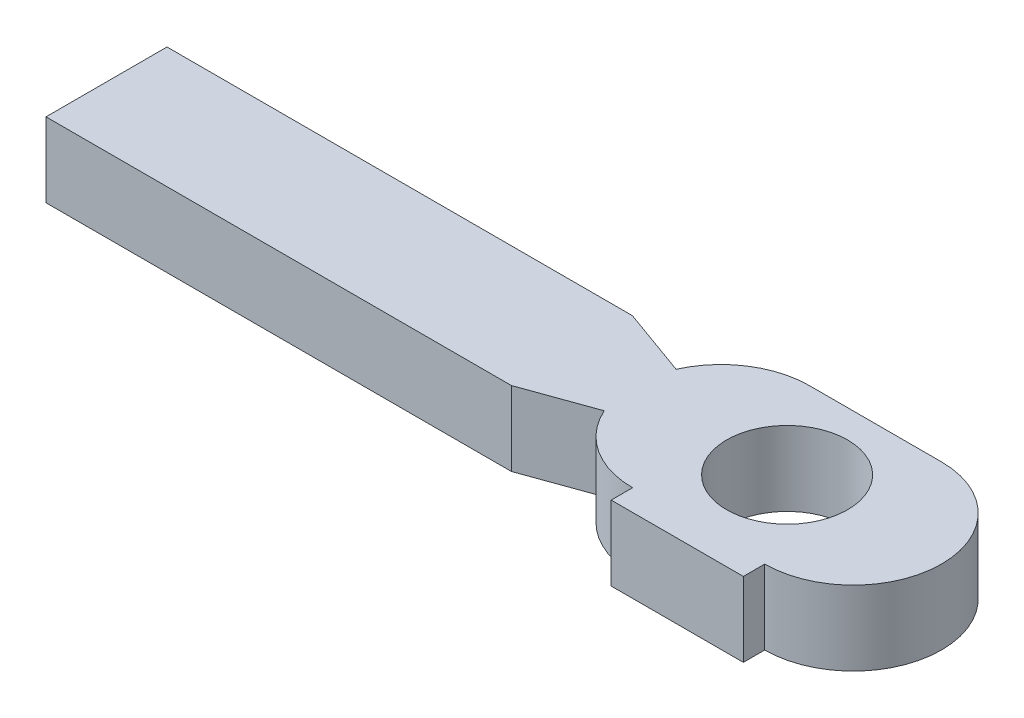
ISO-10303-21;
HEADER;
FILE_DESCRIPTION(('STEP AP214'),'2;1');
FILE_NAME('part.step','',(''),(''),'','','');
FILE_SCHEMA(('AUTOMOTIVE_DESIGN { 1 0 10303 214 1 1 1 1 }'));
ENDSEC;
DATA;
#1=APPLICATION_CONTEXT('core data for automotive mechanical design processes');
#2=APPLICATION_PROTOCOL_DEFINITION('international standard','automotive_design',2000,#1);
#3=PRODUCT_CONTEXT('',#1,'mechanical');
#4=PRODUCT('Part','Part','',(#3));
#5=PRODUCT_RELATED_PRODUCT_CATEGORY('part','',(#4));
#6=PRODUCT_DEFINITION_FORMATION('','',#4);
#7=PRODUCT_DEFINITION_CONTEXT('part definition',#1,'design');
#8=PRODUCT_DEFINITION('design','',#6,#7);
#9=PRODUCT_DEFINITION_SHAPE('','',#8);
#10=(LENGTH_UNIT() NAMED_UNIT(*) SI_UNIT(.MILLI.,.METRE.));
#11=(NAMED_UNIT(*) PLANE_ANGLE_UNIT() SI_UNIT($,.RADIAN.));
#12=(NAMED_UNIT(*) SI_UNIT($,.STERADIAN.) SOLID_ANGLE_UNIT());
#13=UNCERTAINTY_MEASURE_WITH_UNIT(LENGTH_MEASURE(1.E-05),#10,'distance_accuracy_value','');
#14=(GEOMETRIC_REPRESENTATION_CONTEXT(3) GLOBAL_UNCERTAINTY_ASSIGNED_CONTEXT((#13)) GLOBAL_UNIT_ASSIGNED_CONTEXT((#10,
#11,#12)) REPRESENTATION_CONTEXT('',''));
#15=CARTESIAN_POINT('',(0.,0.,0.));
#16=DIRECTION('',(0.,0.,1.));
#17=DIRECTION('',(1.,0.,0.));
#18=AXIS2_PLACEMENT_3D('',#15,#16,#17);
#19=CARTESIAN_POINT('',(1.84067736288,-5.,66.20740131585));
#20=DIRECTION('',(0.,-1.,0.));
#21=DIRECTION('',(0.,0.,1.));
#22=AXIS2_PLACEMENT_3D('',#19,#20,#21);
#23=PLANE('',#22);
#24=CARTESIAN_POINT('',(0.,-5.,67.2));
#25=DIRECTION('',(0.,-1.,0.));
#26=DIRECTION('',(0.,0.,-1.));
#27=AXIS2_PLACEMENT_3D('',#24,#25,#26);
#28=CIRCLE('',#27,0.649999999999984);
#29=CARTESIAN_POINT('',(0.,-5.,66.55));
#30=VERTEX_POINT('',#29);
#31=EDGE_CURVE('E133',#30,#30,#28,.F.);
#32=ORIENTED_EDGE('',*,*,#31,.T.);
#33=EDGE_LOOP('',(#32));
#34=FACE_BOUND('',#33,.T.);
#35=DIRECTION('',(0.,0.,-1.));
#36=VECTOR('',#35,1.);
#37=CARTESIAN_POINT('',(0.71,-5.,68.26496710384));
#38=LINE('',#37,#36);
#39=CARTESIAN_POINT('',(0.71,-5.,68.15));
#40=VERTEX_POINT('',#39);
#41=CARTESIAN_POINT('',(0.71,-5.,68.37993420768));
#42=VERTEX_POINT('',#41);
#43=EDGE_CURVE('E185',#40,#42,#38,.F.);
#44=ORIENTED_EDGE('',*,*,#43,.T.);
#45=DIRECTION('',(1.,0.,0.));
#46=VECTOR('',#45,1.);
#47=CARTESIAN_POINT('',(0.,-5.,68.37993420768));
#48=LINE('',#47,#46);
#49=CARTESIAN_POINT('',(-0.71,-5.,68.37993420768));
#50=VERTEX_POINT('',#49);
#51=EDGE_CURVE('E180',#42,#50,#48,.F.);
#52=ORIENTED_EDGE('',*,*,#51,.T.);
#53=DIRECTION('',(0.,0.,1.));
#54=VECTOR('',#53,1.);
#55=CARTESIAN_POINT('',(-0.71,-5.,68.26496710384));
#56=LINE('',#55,#54);
#57=CARTESIAN_POINT('',(-0.710000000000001,-5.,68.15));
#58=VERTEX_POINT('',#57);
#59=EDGE_CURVE('E174',#50,#58,#56,.F.);
#60=ORIENTED_EDGE('',*,*,#59,.T.);
#61=CARTESIAN_POINT('',(-0.71,-5.,67.2));
#62=DIRECTION('',(0.,-1.,0.));
#63=DIRECTION('',(0.,0.,-1.));
#64=AXIS2_PLACEMENT_3D('',#61,#62,#63);
#65=CIRCLE('',#64,0.95);
#66=CARTESIAN_POINT('',(-1.57806704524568,-5.,67.5859528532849));
#67=VERTEX_POINT('',#66);
#68=EDGE_CURVE('E208',#58,#67,#65,.T.);
#69=ORIENTED_EDGE('',*,*,#68,.T.);
#70=DIRECTION('',(0.940934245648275,0.,-0.338589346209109));
#71=VECTOR('',#70,1.);
#72=CARTESIAN_POINT('',(-1.944958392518,-5.,67.71797642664));
#73=LINE('',#72,#71);
#74=CARTESIAN_POINT('',(-2.31184973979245,-5.,67.8499999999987));
#75=VERTEX_POINT('',#74);
#76=EDGE_CURVE('E169',#67,#75,#73,.F.);
#77=ORIENTED_EDGE('',*,*,#76,.T.);
#78=DIRECTION('',(1.,0.,0.));
#79=VECTOR('',#78,1.);
#80=CARTESIAN_POINT('',(-4.811849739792,-5.,67.85));
#81=LINE('',#80,#79);
#82=CARTESIAN_POINT('',(-7.311849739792,-5.,67.85));
#83=VERTEX_POINT('',#82);
#84=EDGE_CURVE('E162',#75,#83,#81,.F.);
#85=ORIENTED_EDGE('',*,*,#84,.T.);
#86=DIRECTION('',(0.,0.,1.));
#87=VECTOR('',#86,1.);
#88=CARTESIAN_POINT('',(-7.311849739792,-5.,67.2));
#89=LINE('',#88,#87);
#90=CARTESIAN_POINT('',(-7.311849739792,-5.,66.55));
#91=VERTEX_POINT('',#90);
#92=EDGE_CURVE('E148',#83,#91,#89,.F.);
#93=ORIENTED_EDGE('',*,*,#92,.T.);
#94=DIRECTION('',(-1.,0.,0.));
#95=VECTOR('',#94,1.);
#96=CARTESIAN_POINT('',(-4.811849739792,-5.,66.55));
#97=LINE('',#96,#95);
#98=CARTESIAN_POINT('',(-2.31184973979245,-5.,66.5500000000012));
#99=VERTEX_POINT('',#98);
#100=EDGE_CURVE('E134',#91,#99,#97,.F.);
#101=ORIENTED_EDGE('',*,*,#100,.T.);
#102=DIRECTION('',(-0.940934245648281,0.,-0.338589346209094));
#103=VECTOR('',#102,1.);
#104=CARTESIAN_POINT('',(-1.944958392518,-5.,66.68202357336));
#105=LINE('',#104,#103);
#106=CARTESIAN_POINT('',(-1.57806704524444,-5.,66.8140471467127));
#107=VERTEX_POINT('',#106);
#108=EDGE_CURVE('E104',#99,#107,#105,.F.);
#109=ORIENTED_EDGE('',*,*,#108,.T.);
#110=CARTESIAN_POINT('',(-0.71,-5.,67.2));
#111=DIRECTION('',(0.,-1.,0.));
#112=DIRECTION('',(0.,0.,-1.));
#113=AXIS2_PLACEMENT_3D('',#110,#111,#112);
#114=CIRCLE('',#113,0.95);
#115=CARTESIAN_POINT('',(-0.71,-5.,66.25));
#116=VERTEX_POINT('',#115);
#117=EDGE_CURVE('E20',#107,#116,#114,.T.);
#118=ORIENTED_EDGE('',*,*,#117,.T.);
#119=DIRECTION('',(-1.,0.,0.));
#120=VECTOR('',#119,1.);
#121=CARTESIAN_POINT('',(0.,-5.,66.25));
#122=LINE('',#121,#120);
#123=CARTESIAN_POINT('',(0.710000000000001,-5.,66.25));
#124=VERTEX_POINT('',#123);
#125=EDGE_CURVE('E107',#116,#124,#122,.F.);
#126=ORIENTED_EDGE('',*,*,#125,.T.);
#127=CARTESIAN_POINT('',(0.71,-5.,67.2));
#128=DIRECTION('',(0.,1.,0.));
#129=DIRECTION('',(0.,0.,1.));
#130=AXIS2_PLACEMENT_3D('',#127,#128,#129);
#131=CIRCLE('',#130,0.95);
#132=EDGE_CURVE('E209',#124,#40,#131,.F.);
#133=ORIENTED_EDGE('',*,*,#132,.T.);
#134=EDGE_LOOP('',(#44,#52,#60,#69,#77,#85,#93,#101,#109,#118,#126,#133));
#135=FACE_BOUND('',#134,.T.);
#136=ADVANCED_FACE('F16',(#34,#135),#23,.T.);
#137=CARTESIAN_POINT('',(-1.563391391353,-5.016,66.81932808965));
#138=DIRECTION('',(0.338589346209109,0.,-0.940934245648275));
#139=DIRECTION('',(-0.940934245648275,0.,-0.338589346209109));
#140=AXIS2_PLACEMENT_3D('',#137,#138,#139);
#141=PLANE('',#140);
#142=DIRECTION('',(0.,-1.,0.));
#143=VECTOR('',#142,1.);
#144=CARTESIAN_POINT('',(-2.311849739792,-4.6,66.55));
#145=LINE('',#144,#143);
#146=CARTESIAN_POINT('',(-2.3118497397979,-4.2,66.55));
#147=VERTEX_POINT('',#146);
#148=EDGE_CURVE('E130',#99,#147,#145,.F.);
#149=ORIENTED_EDGE('',*,*,#148,.T.);
#150=DIRECTION('',(-0.940934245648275,0.,-0.338589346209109));
#151=VECTOR('',#150,1.);
#152=CARTESIAN_POINT('',(-1.563391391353,-4.2,66.81932808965));
#153=LINE('',#152,#151);
#154=CARTESIAN_POINT('',(-1.57806704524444,-4.2,66.8140471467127));
#155=VERTEX_POINT('',#154);
#156=EDGE_CURVE('E203',#147,#155,#153,.F.);
#157=ORIENTED_EDGE('',*,*,#156,.T.);
#158=DIRECTION('',(0.,-1.,0.));
#159=VECTOR('',#158,1.);
#160=CARTESIAN_POINT('',(-1.57806704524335,-4.6,66.8140471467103));
#161=LINE('',#160,#159);
#162=EDGE_CURVE('E113',#155,#107,#161,.T.);
#163=ORIENTED_EDGE('',*,*,#162,.T.);
#164=ORIENTED_EDGE('',*,*,#108,.F.);
#165=EDGE_LOOP('',(#149,#157,#163,#164));
#166=FACE_BOUND('',#165,.T.);
#167=ADVANCED_FACE('F312',(#166),#141,.T.);
#168=CARTESIAN_POINT('',(-0.71,-4.2,67.2));
#169=DIRECTION('',(0.,-1.,0.));
#170=DIRECTION('',(0.,0.,-1.));
#171=AXIS2_PLACEMENT_3D('',#168,#169,#170);
#172=CYLINDRICAL_SURFACE('',#171,0.95);
#173=DIRECTION('',(0.,1.,0.));
#174=VECTOR('',#173,1.);
#175=CARTESIAN_POINT('',(-0.71,-4.6,66.25));
#176=LINE('',#175,#174);
#177=CARTESIAN_POINT('',(-0.71,-4.2,66.25));
#178=VERTEX_POINT('',#177);
#179=EDGE_CURVE('E112',#178,#116,#176,.F.);
#180=ORIENTED_EDGE('',*,*,#179,.T.);
#181=ORIENTED_EDGE('',*,*,#117,.F.);
#182=ORIENTED_EDGE('',*,*,#162,.F.);
#183=CARTESIAN_POINT('',(-0.71,-4.2,67.2));
#184=DIRECTION('',(0.,-1.,0.));
#185=DIRECTION('',(0.,0.,-1.));
#186=AXIS2_PLACEMENT_3D('',#183,#184,#185);
#187=CIRCLE('',#186,0.95);
#188=EDGE_CURVE('E124',#155,#178,#187,.T.);
#189=ORIENTED_EDGE('',*,*,#188,.T.);
#190=EDGE_LOOP('',(#180,#181,#182,#189));
#191=FACE_BOUND('',#190,.T.);
#192=ADVANCED_FACE('F122',(#191),#172,.T.);
#193=CARTESIAN_POINT('',(-0.7384,-4.184,66.25));
#194=DIRECTION('',(0.,0.,-1.));
#195=DIRECTION('',(1.,0.,0.));
#196=AXIS2_PLACEMENT_3D('',#193,#194,#195);
#197=PLANE('',#196);
#198=ORIENTED_EDGE('',*,*,#125,.F.);
#199=ORIENTED_EDGE('',*,*,#179,.F.);
#200=DIRECTION('',(1.,0.,0.));
#201=VECTOR('',#200,1.);
#202=CARTESIAN_POINT('',(-2.8253338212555,-4.2,66.25));
#203=LINE('',#202,#201);
#204=CARTESIAN_POINT('',(0.710000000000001,-4.2,66.25));
#205=VERTEX_POINT('',#204);
#206=EDGE_CURVE('E201',#178,#205,#203,.T.);
#207=ORIENTED_EDGE('',*,*,#206,.T.);
#208=DIRECTION('',(0.,-1.,0.));
#209=VECTOR('',#208,1.);
#210=CARTESIAN_POINT('',(0.710000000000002,-4.6,66.25));
#211=LINE('',#210,#209);
#212=EDGE_CURVE('E119',#205,#124,#211,.T.);
#213=ORIENTED_EDGE('',*,*,#212,.T.);
#214=EDGE_LOOP('',(#198,#199,#207,#213));
#215=FACE_BOUND('',#214,.T.);
#216=ADVANCED_FACE('F116',(#215),#197,.T.);
#217=CARTESIAN_POINT('',(0.71,-5.,67.2));
#218=DIRECTION('',(0.,1.,0.));
#219=DIRECTION('',(0.,0.,1.));
#220=AXIS2_PLACEMENT_3D('',#217,#218,#219);
#221=CYLINDRICAL_SURFACE('',#220,0.95);
#222=ORIENTED_EDGE('',*,*,#212,.F.);
#223=CARTESIAN_POINT('',(0.71,-4.2,67.2));
#224=DIRECTION('',(0.,1.,0.));
#225=DIRECTION('',(0.,0.,1.));
#226=AXIS2_PLACEMENT_3D('',#223,#224,#225);
#227=CIRCLE('',#226,0.95);
#228=CARTESIAN_POINT('',(0.71,-4.2,68.15));
#229=VERTEX_POINT('',#228);
#230=EDGE_CURVE('E197',#205,#229,#227,.F.);
#231=ORIENTED_EDGE('',*,*,#230,.T.);
#232=DIRECTION('',(0.,1.,0.));
#233=VECTOR('',#232,1.);
#234=CARTESIAN_POINT('',(0.71,-4.6,68.15));
#235=LINE('',#234,#233);
#236=EDGE_CURVE('E187',#229,#40,#235,.F.);
#237=ORIENTED_EDGE('',*,*,#236,.T.);
#238=ORIENTED_EDGE('',*,*,#132,.F.);
#239=EDGE_LOOP('',(#222,#231,#237,#238));
#240=FACE_BOUND('',#239,.T.);
#241=ADVANCED_FACE('F263',(#240),#221,.T.);
#242=CARTESIAN_POINT('',(0.71,-5.016,68.39104263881));
#243=DIRECTION('',(1.,0.,0.));
#244=DIRECTION('',(0.,0.,-1.));
#245=AXIS2_PLACEMENT_3D('',#242,#243,#244);
#246=PLANE('',#245);
#247=ORIENTED_EDGE('',*,*,#43,.F.);
#248=ORIENTED_EDGE('',*,*,#236,.F.);
#249=DIRECTION('',(0.,0.,1.));
#250=VECTOR('',#249,1.);
#251=CARTESIAN_POINT('',(0.71,-4.2,67.31496710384));
#252=LINE('',#251,#250);
#253=CARTESIAN_POINT('',(0.71,-4.2,68.37993420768));
#254=VERTEX_POINT('',#253);
#255=EDGE_CURVE('E200',#229,#254,#252,.T.);
#256=ORIENTED_EDGE('',*,*,#255,.T.);
#257=DIRECTION('',(0.,1.,0.));
#258=VECTOR('',#257,1.);
#259=CARTESIAN_POINT('',(0.71,-4.6,68.37993420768));
#260=LINE('',#259,#258);
#261=EDGE_CURVE('E182',#254,#42,#260,.F.);
#262=ORIENTED_EDGE('',*,*,#261,.T.);
#263=EDGE_LOOP('',(#247,#248,#256,#262));
#264=FACE_BOUND('',#263,.T.);
#265=ADVANCED_FACE('F261',(#264),#246,.T.);
#266=CARTESIAN_POINT('',(-0.7384,-5.016,68.37993420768));
#267=DIRECTION('',(0.,0.,1.));
#268=DIRECTION('',(1.,0.,0.));
#269=AXIS2_PLACEMENT_3D('',#266,#267,#268);
#270=PLANE('',#269);
#271=ORIENTED_EDGE('',*,*,#51,.F.);
#272=ORIENTED_EDGE('',*,*,#261,.F.);
#273=DIRECTION('',(-1.,0.,0.));
#274=VECTOR('',#273,1.);
#275=CARTESIAN_POINT('',(-2.8253338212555,-4.2,68.37993420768));
#276=LINE('',#275,#274);
#277=CARTESIAN_POINT('',(-0.710000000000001,-4.2,68.37993420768));
#278=VERTEX_POINT('',#277);
#279=EDGE_CURVE('E220',#254,#278,#276,.T.);
#280=ORIENTED_EDGE('',*,*,#279,.T.);
#281=DIRECTION('',(0.,1.,0.));
#282=VECTOR('',#281,1.);
#283=CARTESIAN_POINT('',(-0.71,-4.6,68.37993420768));
#284=LINE('',#283,#282);
#285=EDGE_CURVE('E177',#278,#50,#284,.F.);
#286=ORIENTED_EDGE('',*,*,#285,.T.);
#287=EDGE_LOOP('',(#271,#272,#280,#286));
#288=FACE_BOUND('',#287,.T.);
#289=ADVANCED_FACE('F259',(#288),#270,.T.);
#290=CARTESIAN_POINT('',(-0.71,-5.016,68.13889156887));
#291=DIRECTION('',(-1.,0.,0.));
#292=DIRECTION('',(0.,0.,1.));
#293=AXIS2_PLACEMENT_3D('',#290,#291,#292);
#294=PLANE('',#293);
#295=ORIENTED_EDGE('',*,*,#285,.F.);
#296=DIRECTION('',(0.,0.,-1.));
#297=VECTOR('',#296,1.);
#298=CARTESIAN_POINT('',(-0.710000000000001,-4.2,67.31496710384));
#299=LINE('',#298,#297);
#300=CARTESIAN_POINT('',(-0.710000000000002,-4.2,68.15));
#301=VERTEX_POINT('',#300);
#302=EDGE_CURVE('E196',#278,#301,#299,.T.);
#303=ORIENTED_EDGE('',*,*,#302,.T.);
#304=DIRECTION('',(0.,-1.,0.));
#305=VECTOR('',#304,1.);
#306=CARTESIAN_POINT('',(-0.710000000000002,-4.6,68.15));
#307=LINE('',#306,#305);
#308=EDGE_CURVE('E176',#301,#58,#307,.T.);
#309=ORIENTED_EDGE('',*,*,#308,.T.);
#310=ORIENTED_EDGE('',*,*,#59,.F.);
#311=EDGE_LOOP('',(#295,#303,#309,#310));
#312=FACE_BOUND('',#311,.T.);
#313=ADVANCED_FACE('F249',(#312),#294,.T.);
#314=CARTESIAN_POINT('',(-0.71,-4.2,67.2));
#315=DIRECTION('',(0.,-1.,0.));
#316=DIRECTION('',(0.,0.,-1.));
#317=AXIS2_PLACEMENT_3D('',#314,#315,#316);
#318=CYLINDRICAL_SURFACE('',#317,0.95);
#319=ORIENTED_EDGE('',*,*,#68,.F.);
#320=ORIENTED_EDGE('',*,*,#308,.F.);
#321=CARTESIAN_POINT('',(-0.71,-4.2,67.2));
#322=DIRECTION('',(0.,-1.,0.));
#323=DIRECTION('',(0.,0.,-1.));
#324=AXIS2_PLACEMENT_3D('',#321,#322,#323);
#325=CIRCLE('',#324,0.95);
#326=CARTESIAN_POINT('',(-1.57806704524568,-4.2,67.5859528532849));
#327=VERTEX_POINT('',#326);
#328=EDGE_CURVE('E193',#301,#327,#325,.T.);
#329=ORIENTED_EDGE('',*,*,#328,.T.);
#330=DIRECTION('',(0.,1.,0.));
#331=VECTOR('',#330,1.);
#332=CARTESIAN_POINT('',(-1.57806704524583,-4.6,67.5859528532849));
#333=LINE('',#332,#331);
#334=EDGE_CURVE('E171',#327,#67,#333,.F.);
#335=ORIENTED_EDGE('',*,*,#334,.T.);
#336=EDGE_LOOP('',(#319,#320,#329,#335));
#337=FACE_BOUND('',#336,.T.);
#338=ADVANCED_FACE('F291',(#337),#318,.T.);
#339=CARTESIAN_POINT('',(-2.326525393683,-5.016,67.85528094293));
#340=DIRECTION('',(0.338589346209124,0.,0.94093424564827));
#341=DIRECTION('',(0.94093424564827,0.,-0.338589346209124));
#342=AXIS2_PLACEMENT_3D('',#339,#340,#341);
#343=PLANE('',#342);
#344=DIRECTION('',(0.,1.,0.));
#345=VECTOR('',#344,1.);
#346=CARTESIAN_POINT('',(-2.311849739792,-4.6,67.85));
#347=LINE('',#346,#345);
#348=CARTESIAN_POINT('',(-2.31184973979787,-4.2,67.85));
#349=VERTEX_POINT('',#348);
#350=EDGE_CURVE('E166',#349,#75,#347,.F.);
#351=ORIENTED_EDGE('',*,*,#350,.T.);
#352=ORIENTED_EDGE('',*,*,#76,.F.);
#353=ORIENTED_EDGE('',*,*,#334,.F.);
#354=DIRECTION('',(0.94093424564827,0.,-0.338589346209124));
#355=VECTOR('',#354,1.);
#356=CARTESIAN_POINT('',(-2.326525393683,-4.2,67.85528094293));
#357=LINE('',#356,#355);
#358=EDGE_CURVE('E190',#327,#349,#357,.F.);
#359=ORIENTED_EDGE('',*,*,#358,.T.);
#360=EDGE_LOOP('',(#351,#352,#353,#359));
#361=FACE_BOUND('',#360,.T.);
#362=ADVANCED_FACE('F293',(#361),#343,.T.);
#363=CARTESIAN_POINT('',(-7.411849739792,-5.016,67.85));
#364=DIRECTION('',(0.,0.,1.));
#365=DIRECTION('',(1.,0.,0.));
#366=AXIS2_PLACEMENT_3D('',#363,#364,#365);
#367=PLANE('',#366);
#368=ORIENTED_EDGE('',*,*,#84,.F.);
#369=ORIENTED_EDGE('',*,*,#350,.F.);
#370=DIRECTION('',(-1.,0.,0.));
#371=VECTOR('',#370,1.);
#372=CARTESIAN_POINT('',(-2.8253338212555,-4.2,67.85));
#373=LINE('',#372,#371);
#374=CARTESIAN_POINT('',(-7.311849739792,-4.2,67.85));
#375=VERTEX_POINT('',#374);
#376=EDGE_CURVE('E157',#349,#375,#373,.T.);
#377=ORIENTED_EDGE('',*,*,#376,.T.);
#378=DIRECTION('',(0.,1.,0.));
#379=VECTOR('',#378,1.);
#380=CARTESIAN_POINT('',(-7.311849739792,-4.6,67.85));
#381=LINE('',#380,#379);
#382=EDGE_CURVE('E152',#375,#83,#381,.F.);
#383=ORIENTED_EDGE('',*,*,#382,.T.);
#384=EDGE_LOOP('',(#368,#369,#377,#383));
#385=FACE_BOUND('',#384,.T.);
#386=ADVANCED_FACE('F299',(#385),#367,.T.);
#387=CARTESIAN_POINT('',(-7.311849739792,-5.016,66.524));
#388=DIRECTION('',(-1.,0.,0.));
#389=DIRECTION('',(0.,0.,1.));
#390=AXIS2_PLACEMENT_3D('',#387,#388,#389);
#391=PLANE('',#390);
#392=ORIENTED_EDGE('',*,*,#92,.F.);
#393=ORIENTED_EDGE('',*,*,#382,.F.);
#394=DIRECTION('',(0.,0.,-1.));
#395=VECTOR('',#394,1.);
#396=CARTESIAN_POINT('',(-7.311849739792,-4.2,67.31496710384));
#397=LINE('',#396,#395);
#398=CARTESIAN_POINT('',(-7.311849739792,-4.2,66.55));
#399=VERTEX_POINT('',#398);
#400=EDGE_CURVE('E138',#375,#399,#397,.T.);
#401=ORIENTED_EDGE('',*,*,#400,.T.);
#402=DIRECTION('',(0.,1.,0.));
#403=VECTOR('',#402,1.);
#404=CARTESIAN_POINT('',(-7.311849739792,-4.6,66.55));
#405=LINE('',#404,#403);
#406=EDGE_CURVE('E35',#399,#91,#405,.F.);
#407=ORIENTED_EDGE('',*,*,#406,.T.);
#408=EDGE_LOOP('',(#392,#393,#401,#407));
#409=FACE_BOUND('',#408,.T.);
#410=ADVANCED_FACE('F289',(#409),#391,.T.);
#411=CARTESIAN_POINT('',(-2.211849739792,-5.016,66.55));
#412=DIRECTION('',(0.,0.,-1.));
#413=DIRECTION('',(-1.,0.,0.));
#414=AXIS2_PLACEMENT_3D('',#411,#412,#413);
#415=PLANE('',#414);
#416=ORIENTED_EDGE('',*,*,#100,.F.);
#417=ORIENTED_EDGE('',*,*,#406,.F.);
#418=DIRECTION('',(1.,0.,0.));
#419=VECTOR('',#418,1.);
#420=CARTESIAN_POINT('',(-2.8253338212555,-4.2,66.55));
#421=LINE('',#420,#419);
#422=EDGE_CURVE('E26',#399,#147,#421,.T.);
#423=ORIENTED_EDGE('',*,*,#422,.T.);
#424=ORIENTED_EDGE('',*,*,#148,.F.);
#425=EDGE_LOOP('',(#416,#417,#423,#424));
#426=FACE_BOUND('',#425,.T.);
#427=ADVANCED_FACE('F281',(#426),#415,.T.);
#428=CARTESIAN_POINT('',(0.,-4.2,67.2));
#429=DIRECTION('',(0.,-1.,0.));
#430=DIRECTION('',(0.,0.,-1.));
#431=AXIS2_PLACEMENT_3D('',#428,#429,#430);
#432=CYLINDRICAL_SURFACE('',#431,0.649999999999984);
#433=ORIENTED_EDGE('',*,*,#31,.F.);
#434=EDGE_LOOP('',(#433));
#435=FACE_BOUND('',#434,.T.);
#436=CARTESIAN_POINT('',(0.,-4.2,67.2));
#437=DIRECTION('',(0.,-1.,0.));
#438=DIRECTION('',(0.,0.,-1.));
#439=AXIS2_PLACEMENT_3D('',#436,#437,#438);
#440=CIRCLE('',#439,0.649999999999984);
#441=CARTESIAN_POINT('',(0.,-4.2,66.55));
#442=VERTEX_POINT('',#441);
#443=EDGE_CURVE('E11',#442,#442,#440,.F.);
#444=ORIENTED_EDGE('',*,*,#443,.T.);
#445=EDGE_LOOP('',(#444));
#446=FACE_BOUND('',#445,.T.);
#447=ADVANCED_FACE('F276',(#435,#446),#432,.F.);
#448=CARTESIAN_POINT('',(1.840642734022,-4.2,66.20740131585));
#449=DIRECTION('',(0.,-1.,0.));
#450=DIRECTION('',(0.,0.,1.));
#451=AXIS2_PLACEMENT_3D('',#448,#449,#450);
#452=PLANE('',#451);
#453=ORIENTED_EDGE('',*,*,#443,.F.);
#454=EDGE_LOOP('',(#453));
#455=FACE_BOUND('',#454,.T.);
#456=ORIENTED_EDGE('',*,*,#400,.F.);
#457=ORIENTED_EDGE('',*,*,#376,.F.);
#458=ORIENTED_EDGE('',*,*,#358,.F.);
#459=ORIENTED_EDGE('',*,*,#328,.F.);
#460=ORIENTED_EDGE('',*,*,#302,.F.);
#461=ORIENTED_EDGE('',*,*,#279,.F.);
#462=ORIENTED_EDGE('',*,*,#255,.F.);
#463=ORIENTED_EDGE('',*,*,#230,.F.);
#464=ORIENTED_EDGE('',*,*,#206,.F.);
#465=ORIENTED_EDGE('',*,*,#188,.F.);
#466=ORIENTED_EDGE('',*,*,#156,.F.);
#467=ORIENTED_EDGE('',*,*,#422,.F.);
#468=EDGE_LOOP('',(#456,#457,#458,#459,#460,#461,#462,#463,#464,#465,#466,#467));
#469=FACE_BOUND('',#468,.T.);
#470=ADVANCED_FACE('F18',(#455,#469),#452,.F.);
#471=CLOSED_SHELL('',(#136,#167,#192,#216,#241,#265,#289,#313,#338,#362,#386,#410,#427,#447,#470));
#472=MANIFOLD_SOLID_BREP('B1',#471);
#473=ADVANCED_BREP_SHAPE_REPRESENTATION('',(#18,#472),#14);
#474=SHAPE_DEFINITION_REPRESENTATION(#9,#473);
ENDSEC;
END-ISO-10303-21;
